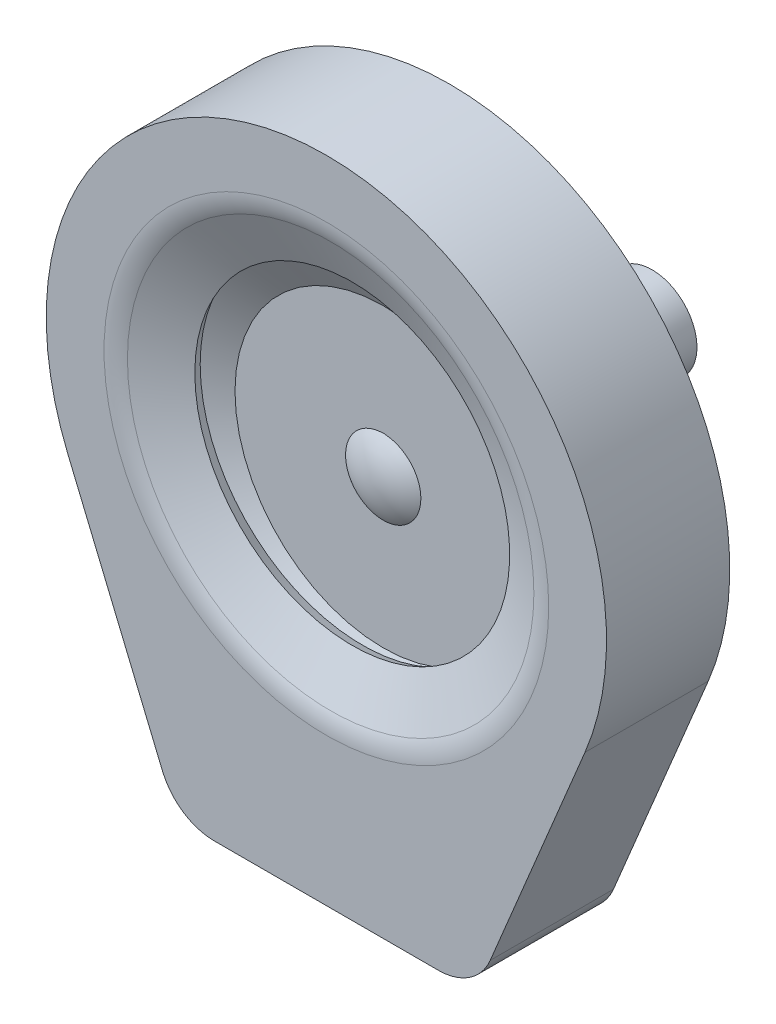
ISO-10303-21;
HEADER;
FILE_DESCRIPTION(('STEP AP214'),'2;1');
FILE_NAME('part.step','',(''),(''),'','','');
FILE_SCHEMA(('AUTOMOTIVE_DESIGN { 1 0 10303 214 1 1 1 1 }'));
ENDSEC;
DATA;
#1=APPLICATION_CONTEXT('core data for automotive mechanical design processes');
#2=APPLICATION_PROTOCOL_DEFINITION('international standard','automotive_design',2000,#1);
#3=PRODUCT_CONTEXT('',#1,'mechanical');
#4=PRODUCT('Part','Part','',(#3));
#5=PRODUCT_RELATED_PRODUCT_CATEGORY('part','',(#4));
#6=PRODUCT_DEFINITION_FORMATION('','',#4);
#7=PRODUCT_DEFINITION_CONTEXT('part definition',#1,'design');
#8=PRODUCT_DEFINITION('design','',#6,#7);
#9=PRODUCT_DEFINITION_SHAPE('','',#8);
#10=(LENGTH_UNIT() NAMED_UNIT(*) SI_UNIT(.MILLI.,.METRE.));
#11=(NAMED_UNIT(*) PLANE_ANGLE_UNIT() SI_UNIT($,.RADIAN.));
#12=(NAMED_UNIT(*) SI_UNIT($,.STERADIAN.) SOLID_ANGLE_UNIT());
#13=UNCERTAINTY_MEASURE_WITH_UNIT(LENGTH_MEASURE(1.E-05),#10,'distance_accuracy_value','');
#14=(GEOMETRIC_REPRESENTATION_CONTEXT(3) GLOBAL_UNCERTAINTY_ASSIGNED_CONTEXT((#13)) GLOBAL_UNIT_ASSIGNED_CONTEXT((#10,
#11,#12)) REPRESENTATION_CONTEXT('',''));
#15=CARTESIAN_POINT('',(0.,0.,0.));
#16=DIRECTION('',(0.,0.,1.));
#17=DIRECTION('',(1.,0.,0.));
#18=AXIS2_PLACEMENT_3D('',#15,#16,#17);
#19=CARTESIAN_POINT('',(0.,20.,2.14285714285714));
#20=DIRECTION('',(0.,0.,1.));
#21=DIRECTION('',(1.,0.,0.));
#22=AXIS2_PLACEMENT_3D('',#19,#20,#21);
#23=PLANE('',#22);
#24=CARTESIAN_POINT('',(0.,0.,2.14285714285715));
#25=DIRECTION('',(0.,0.,-1.));
#26=DIRECTION('',(-1.,0.,0.));
#27=AXIS2_PLACEMENT_3D('',#24,#25,#26);
#28=CIRCLE('',#27,20.);
#29=CARTESIAN_POINT('',(-20.,0.,2.14285714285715));
#30=VERTEX_POINT('',#29);
#31=EDGE_CURVE('E11',#30,#30,#28,.T.);
#32=ORIENTED_EDGE('',*,*,#31,.F.);
#33=EDGE_LOOP('',(#32));
#34=FACE_BOUND('',#33,.T.);
#35=ADVANCED_FACE('F41',(#34),#23,.T.);
#36=CARTESIAN_POINT('',(0.,0.,2.14285714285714));
#37=DIRECTION('',(0.,0.,-1.));
#38=DIRECTION('',(-1.,0.,0.));
#39=AXIS2_PLACEMENT_3D('',#36,#37,#38);
#40=CYLINDRICAL_SURFACE('',#39,20.);
#41=ORIENTED_EDGE('',*,*,#31,.T.);
#42=EDGE_LOOP('',(#41));
#43=FACE_BOUND('',#42,.T.);
#44=CARTESIAN_POINT('',(0.,0.,-3.85714285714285));
#45=DIRECTION('',(0.,0.,-1.));
#46=DIRECTION('',(-1.,0.,0.));
#47=AXIS2_PLACEMENT_3D('',#44,#45,#46);
#48=CIRCLE('',#47,20.);
#49=CARTESIAN_POINT('',(-20.,0.,-3.85714285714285));
#50=VERTEX_POINT('',#49);
#51=EDGE_CURVE('E47',#50,#50,#48,.T.);
#52=ORIENTED_EDGE('',*,*,#51,.F.);
#53=EDGE_LOOP('',(#52));
#54=FACE_BOUND('',#53,.T.);
#55=ADVANCED_FACE('F73',(#43,#54),#40,.T.);
#56=CARTESIAN_POINT('',(0.,4.,-3.85714285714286));
#57=DIRECTION('',(0.,0.,-1.));
#58=DIRECTION('',(-1.,0.,0.));
#59=AXIS2_PLACEMENT_3D('',#56,#57,#58);
#60=PLANE('',#59);
#61=ORIENTED_EDGE('',*,*,#51,.T.);
#62=EDGE_LOOP('',(#61));
#63=FACE_BOUND('',#62,.T.);
#64=CARTESIAN_POINT('',(0.,0.,-3.85714285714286));
#65=DIRECTION('',(0.,0.,-1.));
#66=DIRECTION('',(-1.,0.,0.));
#67=AXIS2_PLACEMENT_3D('',#64,#65,#66);
#68=CIRCLE('',#67,4.);
#69=CARTESIAN_POINT('',(-4.,0.,-3.85714285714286));
#70=VERTEX_POINT('',#69);
#71=EDGE_CURVE('E51',#70,#70,#68,.T.);
#72=ORIENTED_EDGE('',*,*,#71,.F.);
#73=EDGE_LOOP('',(#72));
#74=FACE_BOUND('',#73,.T.);
#75=ADVANCED_FACE('F65',(#63,#74),#60,.T.);
#76=CARTESIAN_POINT('',(0.,0.,2.14285714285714));
#77=DIRECTION('',(0.,0.,-1.));
#78=DIRECTION('',(-1.,0.,0.));
#79=AXIS2_PLACEMENT_3D('',#76,#77,#78);
#80=CYLINDRICAL_SURFACE('',#79,4.);
#81=ORIENTED_EDGE('',*,*,#71,.T.);
#82=EDGE_LOOP('',(#81));
#83=FACE_BOUND('',#82,.T.);
#84=CARTESIAN_POINT('',(0.,0.,-21.8571428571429));
#85=DIRECTION('',(0.,0.,-1.));
#86=DIRECTION('',(-1.,0.,0.));
#87=AXIS2_PLACEMENT_3D('',#84,#85,#86);
#88=CIRCLE('',#87,4.);
#89=CARTESIAN_POINT('',(-4.,0.,-21.8571428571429));
#90=VERTEX_POINT('',#89);
#91=EDGE_CURVE('E55',#90,#90,#88,.T.);
#92=ORIENTED_EDGE('',*,*,#91,.F.);
#93=EDGE_LOOP('',(#92));
#94=FACE_BOUND('',#93,.T.);
#95=ADVANCED_FACE('F63',(#83,#94),#80,.T.);
#96=CARTESIAN_POINT('',(0.,0.,-21.8571428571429));
#97=DIRECTION('',(0.,0.,-1.));
#98=DIRECTION('',(-1.,0.,0.));
#99=AXIS2_PLACEMENT_3D('',#96,#97,#98);
#100=PLANE('',#99);
#101=ORIENTED_EDGE('',*,*,#91,.T.);
#102=EDGE_LOOP('',(#101));
#103=FACE_BOUND('',#102,.T.);
#104=ADVANCED_FACE('F61',(#103),#100,.T.);
#105=CLOSED_SHELL('',(#35,#55,#75,#95,#104));
#106=MANIFOLD_SOLID_BREP('B2',#105);
#107=CARTESIAN_POINT('',(0.,18.,4.6673110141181));
#108=DIRECTION('',(0.,0.,-1.));
#109=DIRECTION('',(-1.,0.,0.));
#110=AXIS2_PLACEMENT_3D('',#107,#108,#109);
#111=PLANE('',#110);
#112=CARTESIAN_POINT('',(0.,0.,4.6673110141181));
#113=DIRECTION('',(0.,0.,-1.));
#114=DIRECTION('',(-1.,0.,0.));
#115=AXIS2_PLACEMENT_3D('',#112,#113,#114);
#116=CIRCLE('',#115,22.);
#117=CARTESIAN_POINT('',(-22.,0.,4.6673110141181));
#118=VERTEX_POINT('',#117);
#119=EDGE_CURVE('E40',#118,#118,#116,.T.);
#120=ORIENTED_EDGE('',*,*,#119,.T.);
#121=EDGE_LOOP('',(#120));
#122=FACE_BOUND('',#121,.T.);
#123=CARTESIAN_POINT('',(0.,0.,4.6673110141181));
#124=DIRECTION('',(0.,0.,-1.));
#125=DIRECTION('',(-1.,0.,0.));
#126=AXIS2_PLACEMENT_3D('',#123,#124,#125);
#127=CIRCLE('',#126,18.);
#128=CARTESIAN_POINT('',(18.,0.,4.6673110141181));
#129=VERTEX_POINT('',#128);
#130=EDGE_CURVE('E142',#129,#129,#127,.T.);
#131=ORIENTED_EDGE('',*,*,#130,.F.);
#132=EDGE_LOOP('',(#131));
#133=FACE_BOUND('',#132,.T.);
#134=ADVANCED_FACE('F120',(#122,#133),#111,.T.);
#135=CARTESIAN_POINT('',(0.,0.,-2.51611398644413));
#136=DIRECTION('',(0.,0.,-1.));
#137=DIRECTION('',(-1.,0.,0.));
#138=AXIS2_PLACEMENT_3D('',#135,#136,#137);
#139=CYLINDRICAL_SURFACE('',#138,22.);
#140=ORIENTED_EDGE('',*,*,#119,.F.);
#141=EDGE_LOOP('',(#140));
#142=FACE_BOUND('',#141,.T.);
#143=CARTESIAN_POINT('',(0.,0.,4.8673110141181));
#144=DIRECTION('',(0.,0.,-1.));
#145=DIRECTION('',(-1.,0.,0.));
#146=AXIS2_PLACEMENT_3D('',#143,#144,#145);
#147=CIRCLE('',#146,22.);
#148=CARTESIAN_POINT('',(-22.,0.,4.8673110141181));
#149=VERTEX_POINT('',#148);
#150=EDGE_CURVE('E126',#149,#149,#147,.T.);
#151=ORIENTED_EDGE('',*,*,#150,.T.);
#152=EDGE_LOOP('',(#151));
#153=FACE_BOUND('',#152,.T.);
#154=ADVANCED_FACE('F150',(#142,#153),#139,.T.);
#155=CARTESIAN_POINT('',(0.,18.,4.8673110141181));
#156=DIRECTION('',(0.,0.,-1.));
#157=DIRECTION('',(-1.,0.,0.));
#158=AXIS2_PLACEMENT_3D('',#155,#156,#157);
#159=PLANE('',#158);
#160=ORIENTED_EDGE('',*,*,#150,.F.);
#161=EDGE_LOOP('',(#160));
#162=FACE_BOUND('',#161,.T.);
#163=CARTESIAN_POINT('',(0.,0.,4.8673110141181));
#164=DIRECTION('',(0.,0.,-1.));
#165=DIRECTION('',(-1.,0.,0.));
#166=AXIS2_PLACEMENT_3D('',#163,#164,#165);
#167=CIRCLE('',#166,17.9464101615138);
#168=CARTESIAN_POINT('',(17.9464101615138,0.,4.8673110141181));
#169=VERTEX_POINT('',#168);
#170=EDGE_CURVE('E130',#169,#169,#167,.T.);
#171=ORIENTED_EDGE('',*,*,#170,.T.);
#172=EDGE_LOOP('',(#171));
#173=FACE_BOUND('',#172,.T.);
#174=ADVANCED_FACE('F154',(#162,#173),#159,.F.);
#175=CARTESIAN_POINT('',(0.,0.,-2.17552464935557));
#176=DIRECTION('',(0.,0.,1.));
#177=DIRECTION('',(1.,0.,0.));
#178=AXIS2_PLACEMENT_3D('',#175,#176,#177);
#179=CONICAL_SURFACE('',#178,5.74786096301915,1.0471975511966);
#180=CARTESIAN_POINT('',(0.,0.,-2.17552464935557));
#181=DIRECTION('',(0.,0.,-1.));
#182=DIRECTION('',(-1.,0.,0.));
#183=AXIS2_PLACEMENT_3D('',#180,#181,#182);
#184=CIRCLE('',#183,5.74786096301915);
#185=CARTESIAN_POINT('',(5.74786096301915,0.,-2.17552464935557));
#186=VERTEX_POINT('',#185);
#187=EDGE_CURVE('E134',#186,#186,#184,.T.);
#188=CARTESIAN_POINT('',(17.9464101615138,0.,4.8673110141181));
#189=CARTESIAN_POINT('',(17.8193419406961,0.,4.79394814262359));
#190=CARTESIAN_POINT('',(17.6922737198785,0.,4.72058527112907));
#191=CARTESIAN_POINT('',(17.4381372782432,0.,4.57385952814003));
#192=CARTESIAN_POINT('',(17.3110690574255,0.,4.50049665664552));
#193=CARTESIAN_POINT('',(17.0569326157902,0.,4.35377091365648));
#194=CARTESIAN_POINT('',(16.9298643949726,0.,4.28040804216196));
#195=CARTESIAN_POINT('',(16.6757279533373,0.,4.13368229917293));
#196=CARTESIAN_POINT('',(16.5486597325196,0.,4.06031942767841));
#197=CARTESIAN_POINT('',(16.2945232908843,0.,3.91359368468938));
#198=CARTESIAN_POINT('',(16.1674550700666,0.,3.84023081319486));
#199=CARTESIAN_POINT('',(15.9133186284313,0.,3.69350507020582));
#200=CARTESIAN_POINT('',(15.7862504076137,0.,3.62014219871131));
#201=CARTESIAN_POINT('',(15.5321139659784,0.,3.47341645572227));
#202=CARTESIAN_POINT('',(15.4050457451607,0.,3.40005358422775));
#203=CARTESIAN_POINT('',(15.1509093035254,0.,3.25332784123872));
#204=CARTESIAN_POINT('',(15.0238410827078,0.,3.1799649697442));
#205=CARTESIAN_POINT('',(14.7697046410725,0.,3.03323922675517));
#206=CARTESIAN_POINT('',(14.6426364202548,0.,2.95987635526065));
#207=CARTESIAN_POINT('',(14.3884999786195,0.,2.81315061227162));
#208=CARTESIAN_POINT('',(14.2614317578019,0.,2.7397877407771));
#209=CARTESIAN_POINT('',(14.0072953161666,0.,2.59306199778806));
#210=CARTESIAN_POINT('',(13.8802270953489,0.,2.51969912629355));
#211=CARTESIAN_POINT('',(13.6260906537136,0.,2.37297338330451));
#212=CARTESIAN_POINT('',(13.4990224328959,0.,2.29961051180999));
#213=CARTESIAN_POINT('',(13.2448859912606,0.,2.15288476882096));
#214=CARTESIAN_POINT('',(13.117817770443,0.,2.07952189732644));
#215=CARTESIAN_POINT('',(12.8636813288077,0.,1.93279615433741));
#216=CARTESIAN_POINT('',(12.73661310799,0.,1.85943328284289));
#217=CARTESIAN_POINT('',(12.4824766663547,0.,1.71270753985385));
#218=CARTESIAN_POINT('',(12.3554084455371,0.,1.63934466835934));
#219=CARTESIAN_POINT('',(12.1012720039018,0.,1.4926189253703));
#220=CARTESIAN_POINT('',(11.9742037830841,0.,1.41925605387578));
#221=CARTESIAN_POINT('',(11.7200673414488,0.,1.27253031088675));
#222=CARTESIAN_POINT('',(11.5929991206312,0.,1.19916743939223));
#223=CARTESIAN_POINT('',(11.3388626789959,0.,1.0524416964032));
#224=CARTESIAN_POINT('',(11.2117944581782,0.,0.97907882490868));
#225=CARTESIAN_POINT('',(10.9576580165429,0.,0.832353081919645));
#226=CARTESIAN_POINT('',(10.8305897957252,0.,0.758990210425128));
#227=CARTESIAN_POINT('',(10.5764533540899,0.,0.612264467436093));
#228=CARTESIAN_POINT('',(10.4493851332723,0.,0.538901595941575));
#229=CARTESIAN_POINT('',(10.195248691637,0.,0.39217585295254));
#230=CARTESIAN_POINT('',(10.0681804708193,0.,0.318812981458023));
#231=CARTESIAN_POINT('',(9.81404402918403,0.,0.172087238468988));
#232=CARTESIAN_POINT('',(9.68697580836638,0.,0.098724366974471));
#233=CARTESIAN_POINT('',(9.43283936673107,0.,-0.0480013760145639));
#234=CARTESIAN_POINT('',(9.30577114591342,0.,-0.121364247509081));
#235=CARTESIAN_POINT('',(9.05163470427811,0.,-0.268089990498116));
#236=CARTESIAN_POINT('',(8.92456648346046,0.,-0.341452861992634));
#237=CARTESIAN_POINT('',(8.67043004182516,0.,-0.488178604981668));
#238=CARTESIAN_POINT('',(8.5433618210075,0.,-0.561541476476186));
#239=CARTESIAN_POINT('',(8.2892253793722,0.,-0.708267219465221));
#240=CARTESIAN_POINT('',(8.16215715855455,0.,-0.781630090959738));
#241=CARTESIAN_POINT('',(7.90802071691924,0.,-0.928355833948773));
#242=CARTESIAN_POINT('',(7.78095249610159,0.,-1.00171870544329));
#243=CARTESIAN_POINT('',(7.52681605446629,0.,-1.14844444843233));
#244=CARTESIAN_POINT('',(7.39974783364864,0.,-1.22180731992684));
#245=CARTESIAN_POINT('',(7.14561139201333,0.,-1.36853306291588));
#246=CARTESIAN_POINT('',(7.01854317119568,0.,-1.44189593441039));
#247=CARTESIAN_POINT('',(6.76440672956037,0.,-1.58862167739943));
#248=CARTESIAN_POINT('',(6.63733850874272,0.,-1.66198454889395));
#249=CARTESIAN_POINT('',(6.38320206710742,0.,-1.80871029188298));
#250=CARTESIAN_POINT('',(6.25613384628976,0.,-1.8820731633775));
#251=CARTESIAN_POINT('',(6.00199740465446,0.,-2.02879890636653));
#252=CARTESIAN_POINT('',(5.87492918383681,0.,-2.10216177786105));
#253=CARTESIAN_POINT('',(5.74786096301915,0.,-2.17552464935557));
#254=B_SPLINE_CURVE_WITH_KNOTS('',3,(#188,#189,#190,#191,#192,#193,#194,#195,#196,#197,#198,
#199,#200,#201,#202,#203,#204,#205,#206,#207,#208,#209,#210,#211,#212,#213,#214,#215,#216,#217,
#218,#219,#220,#221,#222,#223,#224,#225,#226,#227,#228,#229,#230,#231,#232,#233,#234,#235,#236,
#237,#238,#239,#240,#241,#242,#243,#244,#245,#246,#247,#248,#249,#250,#251,#252,#253),
.UNSPECIFIED.,.F.,.F.,(4,2,2,2,2,2,2,2,2,2,2,2,2,2,2,2,2,2,2,2,2,2,2,2,2,2,2,2,2,2,2,2,4),(0.,
0.440177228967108,0.88035445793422,1.32053168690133,1.76070891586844,2.20088614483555,
2.64106337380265,3.08124060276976,3.52141783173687,3.96159506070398,4.40177228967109,
4.8419495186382,5.2821267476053,5.72230397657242,6.16248120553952,6.60265843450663,
7.04283566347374,7.48301289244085,7.92319012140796,8.36336735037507,8.80354457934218,
9.24372180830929,9.6838990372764,10.1240762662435,10.5642534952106,11.0044307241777,
11.4446079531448,11.8847851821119,12.324962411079,12.7651396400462,13.2053168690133,
13.6454940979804,14.0856713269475),.UNSPECIFIED.);
#255=EDGE_CURVE('BSEAM159',#169,#186,#254,.T.);
#256=ORIENTED_EDGE('',*,*,#170,.F.);
#257=ORIENTED_EDGE('',*,*,#187,.T.);
#258=ORIENTED_EDGE('',*,*,#255,.T.);
#259=ORIENTED_EDGE('',*,*,#255,.F.);
#260=EDGE_LOOP('',(#256,#258,#257,#259));
#261=FACE_BOUND('',#260,.T.);
#262=ADVANCED_FACE('F159',(#261),#179,.F.);
#263=CARTESIAN_POINT('',(0.,0.,-2.51611398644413));
#264=DIRECTION('',(0.,0.,-1.));
#265=DIRECTION('',(0.,1.,0.));
#266=AXIS2_PLACEMENT_3D('',#263,#264,#265);
#267=SPHERICAL_SURFACE('',#266,5.75794292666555);
#268=ORIENTED_EDGE('',*,*,#187,.F.);
#269=EDGE_LOOP('',(#268));
#270=FACE_BOUND('',#269,.T.);
#271=ADVANCED_FACE('F165',(#270),#267,.T.);
#272=CARTESIAN_POINT('',(0.,0.,-2.51611398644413));
#273=DIRECTION('',(0.,0.,-1.));
#274=DIRECTION('',(0.,1.,0.));
#275=AXIS2_PLACEMENT_3D('',#272,#273,#274);
#276=SPHERICAL_SURFACE('',#275,5.55794292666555);
#277=CARTESIAN_POINT('',(0.,0.,-2.51611398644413));
#278=DIRECTION('',(0.,0.,-1.));
#279=DIRECTION('',(-1.,0.,0.));
#280=AXIS2_PLACEMENT_3D('',#277,#278,#279);
#281=CIRCLE('',#280,5.55794292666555);
#282=CARTESIAN_POINT('',(5.55794292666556,0.,-2.51611398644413));
#283=VERTEX_POINT('',#282);
#284=EDGE_CURVE('E139',#283,#283,#281,.T.);
#285=ORIENTED_EDGE('',*,*,#284,.T.);
#286=EDGE_LOOP('',(#285));
#287=FACE_BOUND('',#286,.T.);
#288=ADVANCED_FACE('F169',(#287),#276,.F.);
#289=CARTESIAN_POINT('',(0.,0.,-2.51611398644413));
#290=DIRECTION('',(0.,0.,1.));
#291=DIRECTION('',(1.,0.,0.));
#292=AXIS2_PLACEMENT_3D('',#289,#290,#291);
#293=CONICAL_SURFACE('',#292,5.55794292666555,1.0471975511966);
#294=CARTESIAN_POINT('',(18.,0.,4.6673110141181));
#295=CARTESIAN_POINT('',(17.8703952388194,0.,4.59248367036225));
#296=CARTESIAN_POINT('',(17.7407904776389,0.,4.51765632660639));
#297=CARTESIAN_POINT('',(17.4815809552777,0.,4.36800163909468));
#298=CARTESIAN_POINT('',(17.3519761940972,0.,4.29317429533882));
#299=CARTESIAN_POINT('',(17.092766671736,0.,4.14351960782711));
#300=CARTESIAN_POINT('',(16.9631619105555,0.,4.06869226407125));
#301=CARTESIAN_POINT('',(16.7039523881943,0.,3.91903757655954));
#302=CARTESIAN_POINT('',(16.5743476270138,0.,3.84421023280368));
#303=CARTESIAN_POINT('',(16.3151381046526,0.,3.69455554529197));
#304=CARTESIAN_POINT('',(16.1855333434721,0.,3.61972820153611));
#305=CARTESIAN_POINT('',(15.9263238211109,0.,3.4700735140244));
#306=CARTESIAN_POINT('',(15.7967190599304,0.,3.39524617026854));
#307=CARTESIAN_POINT('',(15.5375095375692,0.,3.24559148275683));
#308=CARTESIAN_POINT('',(15.4079047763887,0.,3.17076413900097));
#309=CARTESIAN_POINT('',(15.1486952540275,0.,3.02110945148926));
#310=CARTESIAN_POINT('',(15.019090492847,0.,2.9462821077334));
#311=CARTESIAN_POINT('',(14.7598809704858,0.,2.79662742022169));
#312=CARTESIAN_POINT('',(14.6302762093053,0.,2.72180007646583));
#313=CARTESIAN_POINT('',(14.3710666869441,0.,2.57214538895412));
#314=CARTESIAN_POINT('',(14.2414619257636,0.,2.49731804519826));
#315=CARTESIAN_POINT('',(13.9822524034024,0.,2.34766335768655));
#316=CARTESIAN_POINT('',(13.8526476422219,0.,2.27283601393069));
#317=CARTESIAN_POINT('',(13.5934381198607,0.,2.12318132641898));
#318=CARTESIAN_POINT('',(13.4638333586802,0.,2.04835398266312));
#319=CARTESIAN_POINT('',(13.204623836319,0.,1.89869929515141));
#320=CARTESIAN_POINT('',(13.0750190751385,0.,1.82387195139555));
#321=CARTESIAN_POINT('',(12.8158095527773,0.,1.67421726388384));
#322=CARTESIAN_POINT('',(12.6862047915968,0.,1.59938992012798));
#323=CARTESIAN_POINT('',(12.4269952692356,0.,1.44973523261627));
#324=CARTESIAN_POINT('',(12.2973905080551,0.,1.37490788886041));
#325=CARTESIAN_POINT('',(12.0381809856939,0.,1.2252532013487));
#326=CARTESIAN_POINT('',(11.9085762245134,0.,1.15042585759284));
#327=CARTESIAN_POINT('',(11.6493667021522,0.,1.00077117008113));
#328=CARTESIAN_POINT('',(11.5197619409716,0.,0.925943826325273));
#329=CARTESIAN_POINT('',(11.2605524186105,0.,0.77628913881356));
#330=CARTESIAN_POINT('',(11.1309476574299,0.,0.701461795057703));
#331=CARTESIAN_POINT('',(10.8717381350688,0.,0.55180710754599));
#332=CARTESIAN_POINT('',(10.7421333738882,0.,0.476979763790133));
#333=CARTESIAN_POINT('',(10.4829238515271,0.,0.32732507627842));
#334=CARTESIAN_POINT('',(10.3533190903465,0.,0.252497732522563));
#335=CARTESIAN_POINT('',(10.0941095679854,0.,0.10284304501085));
#336=CARTESIAN_POINT('',(9.96450480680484,0.,0.0280157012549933));
#337=CARTESIAN_POINT('',(9.70529528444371,0.,-0.12163898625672));
#338=CARTESIAN_POINT('',(9.57569052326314,0.,-0.196466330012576));
#339=CARTESIAN_POINT('',(9.31648100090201,0.,-0.34612101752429));
#340=CARTESIAN_POINT('',(9.18687623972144,0.,-0.420948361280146));
#341=CARTESIAN_POINT('',(8.9276667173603,0.,-0.57060304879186));
#342=CARTESIAN_POINT('',(8.79806195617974,0.,-0.645430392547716));
#343=CARTESIAN_POINT('',(8.5388524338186,0.,-0.795085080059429));
#344=CARTESIAN_POINT('',(8.40924767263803,0.,-0.869912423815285));
#345=CARTESIAN_POINT('',(8.1500381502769,0.,-1.019567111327));
#346=CARTESIAN_POINT('',(8.02043338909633,0.,-1.09439445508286));
#347=CARTESIAN_POINT('',(7.7612238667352,0.,-1.24404914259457));
#348=CARTESIAN_POINT('',(7.63161910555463,0.,-1.31887648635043));
#349=CARTESIAN_POINT('',(7.3724095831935,0.,-1.46853117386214));
#350=CARTESIAN_POINT('',(7.24280482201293,0.,-1.543358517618));
#351=CARTESIAN_POINT('',(6.9835952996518,0.,-1.69301320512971));
#352=CARTESIAN_POINT('',(6.85399053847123,0.,-1.76784054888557));
#353=CARTESIAN_POINT('',(6.59478101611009,0.,-1.91749523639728));
#354=CARTESIAN_POINT('',(6.46517625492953,0.,-1.99232258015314));
#355=CARTESIAN_POINT('',(6.20596673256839,0.,-2.14197726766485));
#356=CARTESIAN_POINT('',(6.07636197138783,0.,-2.2168046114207));
#357=CARTESIAN_POINT('',(5.81715244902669,0.,-2.36645929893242));
#358=CARTESIAN_POINT('',(5.68754768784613,0.,-2.44128664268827));
#359=CARTESIAN_POINT('',(5.55794292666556,0.,-2.51611398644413));
#360=B_SPLINE_CURVE_WITH_KNOTS('',3,(#294,#295,#296,#297,#298,#299,#300,#301,#302,#303,#304,
#305,#306,#307,#308,#309,#310,#311,#312,#313,#314,#315,#316,#317,#318,#319,#320,#321,#322,#323,
#324,#325,#326,#327,#328,#329,#330,#331,#332,#333,#334,#335,#336,#337,#338,#339,#340,#341,#342,
#343,#344,#345,#346,#347,#348,#349,#350,#351,#352,#353,#354,#355,#356,#357,#358,#359),
.UNSPECIFIED.,.F.,.F.,(4,2,2,2,2,2,2,2,2,2,2,2,2,2,2,2,2,2,2,2,2,2,2,2,2,2,2,2,2,2,2,2,4),(0.,
0.448964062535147,0.897928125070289,1.34689218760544,1.79585625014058,2.24482031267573,
2.69378437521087,3.14274843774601,3.59171250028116,4.0406765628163,4.48964062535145,
4.93860468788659,5.38756875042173,5.83653281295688,6.28549687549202,6.73446093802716,
7.18342500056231,7.63238906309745,8.0813531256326,8.53031718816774,8.97928125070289,
9.42824531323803,9.87720937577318,10.3261734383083,10.7751375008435,11.2241015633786,
11.6730656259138,12.1220296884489,12.570993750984,13.0199578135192,13.4689218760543,
13.9178859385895,14.3668500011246),.UNSPECIFIED.);
#361=EDGE_CURVE('BSEAM146',#129,#283,#360,.T.);
#362=ORIENTED_EDGE('',*,*,#130,.T.);
#363=ORIENTED_EDGE('',*,*,#284,.F.);
#364=ORIENTED_EDGE('',*,*,#361,.T.);
#365=ORIENTED_EDGE('',*,*,#361,.F.);
#366=EDGE_LOOP('',(#362,#364,#363,#365));
#367=FACE_BOUND('',#366,.T.);
#368=ADVANCED_FACE('F146',(#367),#293,.T.);
#369=CLOSED_SHELL('',(#134,#154,#174,#262,#271,#288,#368));
#370=MANIFOLD_SOLID_BREP('B6',#369);
#371=CARTESIAN_POINT('',(0.,2.38841835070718,-3.78590922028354));
#372=DIRECTION('',(0.,0.,1.));
#373=DIRECTION('',(1.,0.,0.));
#374=AXIS2_PLACEMENT_3D('',#371,#372,#373);
#375=PLANE('',#374);
#376=CARTESIAN_POINT('',(0.,2.38841835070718,-3.78590922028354));
#377=DIRECTION('',(0.,0.,1.));
#378=DIRECTION('',(1.,0.,0.));
#379=AXIS2_PLACEMENT_3D('',#376,#377,#378);
#380=CIRCLE('',#379,25.);
#381=CARTESIAN_POINT('',(23.0784258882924,-7.22335872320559,-3.78590922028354));
#382=VERTEX_POINT('',#381);
#383=CARTESIAN_POINT('',(-23.0784258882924,-7.22335872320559,-3.78590922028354));
#384=VERTEX_POINT('',#383);
#385=EDGE_CURVE('E319',#382,#384,#380,.T.);
#386=ORIENTED_EDGE('',*,*,#385,.F.);
#387=DIRECTION('',(0.384471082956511,0.923137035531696,0.));
#388=VECTOR('',#387,1.);
#389=CARTESIAN_POINT('',(14.6194108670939,-27.5339370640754,-3.78590922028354));
#390=LINE('',#389,#388);
#391=CARTESIAN_POINT('',(14.6194108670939,-27.5339370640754,-3.78590922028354));
#392=VERTEX_POINT('',#391);
#393=EDGE_CURVE('E243',#392,#382,#390,.T.);
#394=ORIENTED_EDGE('',*,*,#393,.F.);
#395=CARTESIAN_POINT('',(10.0037256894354,-25.6115816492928,-3.78590922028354));
#396=DIRECTION('',(0.,0.,1.));
#397=DIRECTION('',(1.,0.,0.));
#398=AXIS2_PLACEMENT_3D('',#395,#396,#397);
#399=CIRCLE('',#398,5.);
#400=CARTESIAN_POINT('',(10.0037256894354,-30.6115816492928,-3.78590922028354));
#401=VERTEX_POINT('',#400);
#402=EDGE_CURVE('E404',#401,#392,#399,.T.);
#403=ORIENTED_EDGE('',*,*,#402,.F.);
#404=DIRECTION('',(1.,0.,0.));
#405=VECTOR('',#404,1.);
#406=CARTESIAN_POINT('',(-10.0037256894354,-30.6115816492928,-3.78590922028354));
#407=LINE('',#406,#405);
#408=CARTESIAN_POINT('',(-10.0037256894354,-30.6115816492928,-3.78590922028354));
#409=VERTEX_POINT('',#408);
#410=EDGE_CURVE('E402',#409,#401,#407,.T.);
#411=ORIENTED_EDGE('',*,*,#410,.F.);
#412=CARTESIAN_POINT('',(-10.0037256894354,-25.6115816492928,-3.78590922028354));
#413=DIRECTION('',(0.,0.,1.));
#414=DIRECTION('',(1.,0.,0.));
#415=AXIS2_PLACEMENT_3D('',#412,#413,#414);
#416=CIRCLE('',#415,5.);
#417=CARTESIAN_POINT('',(-14.6194108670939,-27.5339370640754,-3.78590922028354));
#418=VERTEX_POINT('',#417);
#419=EDGE_CURVE('E400',#418,#409,#416,.T.);
#420=ORIENTED_EDGE('',*,*,#419,.F.);
#421=DIRECTION('',(0.384471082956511,-0.923137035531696,0.));
#422=VECTOR('',#421,1.);
#423=CARTESIAN_POINT('',(-14.6194108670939,-27.5339370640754,-3.78590922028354));
#424=LINE('',#423,#422);
#425=EDGE_CURVE('E398',#384,#418,#424,.T.);
#426=ORIENTED_EDGE('',*,*,#425,.F.);
#427=EDGE_LOOP('',(#386,#394,#403,#411,#420,#426));
#428=FACE_BOUND('',#427,.T.);
#429=CARTESIAN_POINT('',(0.,2.38841835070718,-3.78590922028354));
#430=DIRECTION('',(0.,0.,1.));
#431=DIRECTION('',(1.,0.,0.));
#432=AXIS2_PLACEMENT_3D('',#429,#430,#431);
#433=CIRCLE('',#432,24.);
#434=CARTESIAN_POINT('',(22.1552888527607,-6.83888764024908,-3.78590922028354));
#435=VERTEX_POINT('',#434);
#436=CARTESIAN_POINT('',(-22.1552888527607,-6.83888764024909,-3.78590922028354));
#437=VERTEX_POINT('',#436);
#438=EDGE_CURVE('E235',#435,#437,#433,.T.);
#439=ORIENTED_EDGE('',*,*,#438,.T.);
#440=DIRECTION('',(0.384471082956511,-0.923137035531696,0.));
#441=VECTOR('',#440,1.);
#442=CARTESIAN_POINT('',(-13.6962738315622,-27.1494659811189,-3.78590922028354));
#443=LINE('',#442,#441);
#444=CARTESIAN_POINT('',(-13.6962738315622,-27.1494659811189,-3.78590922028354));
#445=VERTEX_POINT('',#444);
#446=EDGE_CURVE('E372',#437,#445,#443,.T.);
#447=ORIENTED_EDGE('',*,*,#446,.T.);
#448=CARTESIAN_POINT('',(-10.0037256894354,-25.6115816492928,-3.78590922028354));
#449=DIRECTION('',(0.,0.,1.));
#450=DIRECTION('',(1.,0.,0.));
#451=AXIS2_PLACEMENT_3D('',#448,#449,#450);
#452=CIRCLE('',#451,4.);
#453=CARTESIAN_POINT('',(-10.0037256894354,-29.6115816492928,-3.78590922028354));
#454=VERTEX_POINT('',#453);
#455=EDGE_CURVE('E375',#445,#454,#452,.T.);
#456=ORIENTED_EDGE('',*,*,#455,.T.);
#457=DIRECTION('',(1.,0.,0.));
#458=VECTOR('',#457,1.);
#459=CARTESIAN_POINT('',(-10.0037256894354,-29.6115816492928,-3.78590922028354));
#460=LINE('',#459,#458);
#461=CARTESIAN_POINT('',(10.0037256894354,-29.6115816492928,-3.78590922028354));
#462=VERTEX_POINT('',#461);
#463=EDGE_CURVE('E378',#454,#462,#460,.T.);
#464=ORIENTED_EDGE('',*,*,#463,.T.);
#465=CARTESIAN_POINT('',(10.0037256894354,-25.6115816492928,-3.78590922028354));
#466=DIRECTION('',(0.,0.,1.));
#467=DIRECTION('',(1.,0.,0.));
#468=AXIS2_PLACEMENT_3D('',#465,#466,#467);
#469=CIRCLE('',#468,4.);
#470=CARTESIAN_POINT('',(13.6962738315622,-27.1494659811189,-3.78590922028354));
#471=VERTEX_POINT('',#470);
#472=EDGE_CURVE('E381',#462,#471,#469,.T.);
#473=ORIENTED_EDGE('',*,*,#472,.T.);
#474=DIRECTION('',(0.384471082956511,0.923137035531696,0.));
#475=VECTOR('',#474,1.);
#476=CARTESIAN_POINT('',(13.6962738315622,-27.1494659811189,-3.78590922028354));
#477=LINE('',#476,#475);
#478=EDGE_CURVE('E355',#471,#435,#477,.T.);
#479=ORIENTED_EDGE('',*,*,#478,.T.);
#480=EDGE_LOOP('',(#439,#447,#456,#464,#473,#479));
#481=FACE_BOUND('',#480,.T.);
#482=ADVANCED_FACE('F220',(#428,#481),#375,.F.);
#483=CARTESIAN_POINT('',(0.,2.38841835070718,6.21409077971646));
#484=DIRECTION('',(0.,0.,-1.));
#485=DIRECTION('',(-1.,0.,0.));
#486=AXIS2_PLACEMENT_3D('',#483,#484,#485);
#487=CYLINDRICAL_SURFACE('',#486,25.);
#488=ORIENTED_EDGE('',*,*,#385,.T.);
#489=DIRECTION('',(0.,0.,-1.));
#490=VECTOR('',#489,1.);
#491=CARTESIAN_POINT('',(-23.0784258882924,-7.22335872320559,6.21409077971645));
#492=LINE('',#491,#490);
#493=CARTESIAN_POINT('',(-23.0784258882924,-7.2233587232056,7.21409077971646));
#494=VERTEX_POINT('',#493);
#495=EDGE_CURVE('E313',#494,#384,#492,.T.);
#496=ORIENTED_EDGE('',*,*,#495,.F.);
#497=CARTESIAN_POINT('',(0.,2.38841835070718,7.21409077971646));
#498=DIRECTION('',(0.,0.,1.));
#499=DIRECTION('',(1.,0.,0.));
#500=AXIS2_PLACEMENT_3D('',#497,#498,#499);
#501=CIRCLE('',#500,25.);
#502=CARTESIAN_POINT('',(23.0784258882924,-7.22335872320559,7.21409077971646));
#503=VERTEX_POINT('',#502);
#504=EDGE_CURVE('E317',#503,#494,#501,.T.);
#505=ORIENTED_EDGE('',*,*,#504,.F.);
#506=DIRECTION('',(0.,0.,-1.));
#507=VECTOR('',#506,1.);
#508=CARTESIAN_POINT('',(23.0784258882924,-7.22335872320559,6.21409077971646));
#509=LINE('',#508,#507);
#510=EDGE_CURVE('E407',#503,#382,#509,.T.);
#511=ORIENTED_EDGE('',*,*,#510,.T.);
#512=EDGE_LOOP('',(#488,#496,#505,#511));
#513=FACE_BOUND('',#512,.T.);
#514=ADVANCED_FACE('F315',(#513),#487,.T.);
#515=CARTESIAN_POINT('',(-14.6194108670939,-27.5339370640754,6.21409077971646));
#516=DIRECTION('',(0.923137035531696,0.384471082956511,0.));
#517=DIRECTION('',(-0.384471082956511,0.923137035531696,0.));
#518=AXIS2_PLACEMENT_3D('',#515,#516,#517);
#519=PLANE('',#518);
#520=ORIENTED_EDGE('',*,*,#425,.T.);
#521=DIRECTION('',(0.,0.,-1.));
#522=VECTOR('',#521,1.);
#523=CARTESIAN_POINT('',(-14.6194108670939,-27.5339370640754,6.21409077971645));
#524=LINE('',#523,#522);
#525=CARTESIAN_POINT('',(-14.6194108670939,-27.5339370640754,7.21409077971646));
#526=VERTEX_POINT('',#525);
#527=EDGE_CURVE('E321',#526,#418,#524,.T.);
#528=ORIENTED_EDGE('',*,*,#527,.F.);
#529=DIRECTION('',(0.384471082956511,-0.923137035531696,0.));
#530=VECTOR('',#529,1.);
#531=CARTESIAN_POINT('',(-23.0784258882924,-7.2233587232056,7.21409077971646));
#532=LINE('',#531,#530);
#533=EDGE_CURVE('E324',#494,#526,#532,.T.);
#534=ORIENTED_EDGE('',*,*,#533,.F.);
#535=ORIENTED_EDGE('',*,*,#495,.T.);
#536=EDGE_LOOP('',(#520,#528,#534,#535));
#537=FACE_BOUND('',#536,.T.);
#538=ADVANCED_FACE('F325',(#537),#519,.F.);
#539=CARTESIAN_POINT('',(-10.0037256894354,-25.6115816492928,6.21409077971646));
#540=DIRECTION('',(0.,0.,-1.));
#541=DIRECTION('',(-1.,0.,0.));
#542=AXIS2_PLACEMENT_3D('',#539,#540,#541);
#543=CYLINDRICAL_SURFACE('',#542,5.);
#544=ORIENTED_EDGE('',*,*,#419,.T.);
#545=DIRECTION('',(0.,0.,-1.));
#546=VECTOR('',#545,1.);
#547=CARTESIAN_POINT('',(-10.0037256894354,-30.6115816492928,6.21409077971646));
#548=LINE('',#547,#546);
#549=CARTESIAN_POINT('',(-10.0037256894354,-30.6115816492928,7.21409077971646));
#550=VERTEX_POINT('',#549);
#551=EDGE_CURVE('E414',#550,#409,#548,.T.);
#552=ORIENTED_EDGE('',*,*,#551,.F.);
#553=CARTESIAN_POINT('',(-10.0037256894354,-25.6115816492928,7.21409077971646));
#554=DIRECTION('',(0.,0.,1.));
#555=DIRECTION('',(1.,0.,0.));
#556=AXIS2_PLACEMENT_3D('',#553,#554,#555);
#557=CIRCLE('',#556,5.);
#558=EDGE_CURVE('E330',#526,#550,#557,.T.);
#559=ORIENTED_EDGE('',*,*,#558,.F.);
#560=ORIENTED_EDGE('',*,*,#527,.T.);
#561=EDGE_LOOP('',(#544,#552,#559,#560));
#562=FACE_BOUND('',#561,.T.);
#563=ADVANCED_FACE('F452',(#562),#543,.T.);
#564=CARTESIAN_POINT('',(-10.0037256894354,-30.6115816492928,6.21409077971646));
#565=DIRECTION('',(0.,1.,0.));
#566=DIRECTION('',(0.,0.,1.));
#567=AXIS2_PLACEMENT_3D('',#564,#565,#566);
#568=PLANE('',#567);
#569=ORIENTED_EDGE('',*,*,#410,.T.);
#570=DIRECTION('',(0.,0.,-1.));
#571=VECTOR('',#570,1.);
#572=CARTESIAN_POINT('',(10.0037256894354,-30.6115816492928,6.21409077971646));
#573=LINE('',#572,#571);
#574=CARTESIAN_POINT('',(10.0037256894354,-30.6115816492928,7.21409077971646));
#575=VERTEX_POINT('',#574);
#576=EDGE_CURVE('E411',#575,#401,#573,.T.);
#577=ORIENTED_EDGE('',*,*,#576,.F.);
#578=DIRECTION('',(1.,0.,0.));
#579=VECTOR('',#578,1.);
#580=CARTESIAN_POINT('',(-10.0037256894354,-30.6115816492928,7.21409077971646));
#581=LINE('',#580,#579);
#582=EDGE_CURVE('E345',#550,#575,#581,.T.);
#583=ORIENTED_EDGE('',*,*,#582,.F.);
#584=ORIENTED_EDGE('',*,*,#551,.T.);
#585=EDGE_LOOP('',(#569,#577,#583,#584));
#586=FACE_BOUND('',#585,.T.);
#587=ADVANCED_FACE('F448',(#586),#568,.F.);
#588=CARTESIAN_POINT('',(10.0037256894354,-25.6115816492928,6.21409077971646));
#589=DIRECTION('',(0.,0.,-1.));
#590=DIRECTION('',(-1.,0.,0.));
#591=AXIS2_PLACEMENT_3D('',#588,#589,#590);
#592=CYLINDRICAL_SURFACE('',#591,5.);
#593=ORIENTED_EDGE('',*,*,#402,.T.);
#594=DIRECTION('',(0.,0.,-1.));
#595=VECTOR('',#594,1.);
#596=CARTESIAN_POINT('',(14.6194108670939,-27.5339370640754,6.21409077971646));
#597=LINE('',#596,#595);
#598=CARTESIAN_POINT('',(14.6194108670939,-27.5339370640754,7.21409077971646));
#599=VERTEX_POINT('',#598);
#600=EDGE_CURVE('E409',#599,#392,#597,.T.);
#601=ORIENTED_EDGE('',*,*,#600,.F.);
#602=CARTESIAN_POINT('',(10.0037256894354,-25.6115816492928,7.21409077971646));
#603=DIRECTION('',(0.,0.,1.));
#604=DIRECTION('',(1.,0.,0.));
#605=AXIS2_PLACEMENT_3D('',#602,#603,#604);
#606=CIRCLE('',#605,5.);
#607=EDGE_CURVE('E348',#575,#599,#606,.T.);
#608=ORIENTED_EDGE('',*,*,#607,.F.);
#609=ORIENTED_EDGE('',*,*,#576,.T.);
#610=EDGE_LOOP('',(#593,#601,#608,#609));
#611=FACE_BOUND('',#610,.T.);
#612=ADVANCED_FACE('F445',(#611),#592,.T.);
#613=CARTESIAN_POINT('',(14.6194108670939,-27.5339370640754,6.21409077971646));
#614=DIRECTION('',(-0.923137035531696,0.384471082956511,0.));
#615=DIRECTION('',(-0.384471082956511,-0.923137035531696,0.));
#616=AXIS2_PLACEMENT_3D('',#613,#614,#615);
#617=PLANE('',#616);
#618=ORIENTED_EDGE('',*,*,#393,.T.);
#619=ORIENTED_EDGE('',*,*,#510,.F.);
#620=DIRECTION('',(0.384471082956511,0.923137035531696,0.));
#621=VECTOR('',#620,1.);
#622=CARTESIAN_POINT('',(14.6194108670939,-27.5339370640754,7.21409077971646));
#623=LINE('',#622,#621);
#624=EDGE_CURVE('E336',#599,#503,#623,.T.);
#625=ORIENTED_EDGE('',*,*,#624,.F.);
#626=ORIENTED_EDGE('',*,*,#600,.T.);
#627=EDGE_LOOP('',(#618,#619,#625,#626));
#628=FACE_BOUND('',#627,.T.);
#629=ADVANCED_FACE('F442',(#628),#617,.F.);
#630=CARTESIAN_POINT('',(0.,2.38841835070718,6.21409077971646));
#631=DIRECTION('',(0.,0.,-1.));
#632=DIRECTION('',(-1.,0.,0.));
#633=AXIS2_PLACEMENT_3D('',#630,#631,#632);
#634=CYLINDRICAL_SURFACE('',#633,24.);
#635=ORIENTED_EDGE('',*,*,#438,.F.);
#636=DIRECTION('',(0.,0.,-1.));
#637=VECTOR('',#636,1.);
#638=CARTESIAN_POINT('',(22.1552888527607,-6.83888764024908,6.21409077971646));
#639=LINE('',#638,#637);
#640=CARTESIAN_POINT('',(22.1552888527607,-6.83888764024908,6.21409077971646));
#641=VERTEX_POINT('',#640);
#642=EDGE_CURVE('E370',#641,#435,#639,.T.);
#643=ORIENTED_EDGE('',*,*,#642,.F.);
#644=CARTESIAN_POINT('',(0.,2.38841835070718,6.21409077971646));
#645=DIRECTION('',(0.,0.,1.));
#646=DIRECTION('',(1.,0.,0.));
#647=AXIS2_PLACEMENT_3D('',#644,#645,#646);
#648=CIRCLE('',#647,24.);
#649=CARTESIAN_POINT('',(-22.1552888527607,-6.83888764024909,6.21409077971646));
#650=VERTEX_POINT('',#649);
#651=EDGE_CURVE('E351',#641,#650,#648,.T.);
#652=ORIENTED_EDGE('',*,*,#651,.T.);
#653=DIRECTION('',(0.,0.,-1.));
#654=VECTOR('',#653,1.);
#655=CARTESIAN_POINT('',(-22.1552888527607,-6.83888764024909,6.21409077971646));
#656=LINE('',#655,#654);
#657=EDGE_CURVE('E395',#650,#437,#656,.T.);
#658=ORIENTED_EDGE('',*,*,#657,.T.);
#659=EDGE_LOOP('',(#635,#643,#652,#658));
#660=FACE_BOUND('',#659,.T.);
#661=ADVANCED_FACE('F440',(#660),#634,.F.);
#662=CARTESIAN_POINT('',(-13.6962738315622,-27.1494659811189,6.21409077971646));
#663=DIRECTION('',(0.923137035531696,0.384471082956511,0.));
#664=DIRECTION('',(-0.384471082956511,0.923137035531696,0.));
#665=AXIS2_PLACEMENT_3D('',#662,#663,#664);
#666=PLANE('',#665);
#667=ORIENTED_EDGE('',*,*,#446,.F.);
#668=ORIENTED_EDGE('',*,*,#657,.F.);
#669=DIRECTION('',(0.384471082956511,-0.923137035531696,0.));
#670=VECTOR('',#669,1.);
#671=CARTESIAN_POINT('',(-13.6962738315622,-27.1494659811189,6.21409077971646));
#672=LINE('',#671,#670);
#673=CARTESIAN_POINT('',(-13.6962738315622,-27.1494659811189,6.21409077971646));
#674=VERTEX_POINT('',#673);
#675=EDGE_CURVE('E354',#650,#674,#672,.T.);
#676=ORIENTED_EDGE('',*,*,#675,.T.);
#677=DIRECTION('',(0.,0.,-1.));
#678=VECTOR('',#677,1.);
#679=CARTESIAN_POINT('',(-13.6962738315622,-27.1494659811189,6.21409077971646));
#680=LINE('',#679,#678);
#681=EDGE_CURVE('E393',#674,#445,#680,.T.);
#682=ORIENTED_EDGE('',*,*,#681,.T.);
#683=EDGE_LOOP('',(#667,#668,#676,#682));
#684=FACE_BOUND('',#683,.T.);
#685=ADVANCED_FACE('F484',(#684),#666,.T.);
#686=CARTESIAN_POINT('',(-10.0037256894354,-25.6115816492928,6.21409077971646));
#687=DIRECTION('',(0.,0.,-1.));
#688=DIRECTION('',(-1.,0.,0.));
#689=AXIS2_PLACEMENT_3D('',#686,#687,#688);
#690=CYLINDRICAL_SURFACE('',#689,4.);
#691=ORIENTED_EDGE('',*,*,#455,.F.);
#692=ORIENTED_EDGE('',*,*,#681,.F.);
#693=CARTESIAN_POINT('',(-10.0037256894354,-25.6115816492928,6.21409077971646));
#694=DIRECTION('',(0.,0.,1.));
#695=DIRECTION('',(1.,0.,0.));
#696=AXIS2_PLACEMENT_3D('',#693,#694,#695);
#697=CIRCLE('',#696,4.);
#698=CARTESIAN_POINT('',(-10.0037256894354,-29.6115816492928,6.21409077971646));
#699=VERTEX_POINT('',#698);
#700=EDGE_CURVE('E358',#674,#699,#697,.T.);
#701=ORIENTED_EDGE('',*,*,#700,.T.);
#702=DIRECTION('',(0.,0.,-1.));
#703=VECTOR('',#702,1.);
#704=CARTESIAN_POINT('',(-10.0037256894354,-29.6115816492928,6.21409077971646));
#705=LINE('',#704,#703);
#706=EDGE_CURVE('E391',#699,#454,#705,.T.);
#707=ORIENTED_EDGE('',*,*,#706,.T.);
#708=EDGE_LOOP('',(#691,#692,#701,#707));
#709=FACE_BOUND('',#708,.T.);
#710=ADVANCED_FACE('F490',(#709),#690,.F.);
#711=CARTESIAN_POINT('',(-10.0037256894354,-29.6115816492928,6.21409077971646));
#712=DIRECTION('',(0.,1.,0.));
#713=DIRECTION('',(0.,0.,1.));
#714=AXIS2_PLACEMENT_3D('',#711,#712,#713);
#715=PLANE('',#714);
#716=ORIENTED_EDGE('',*,*,#463,.F.);
#717=ORIENTED_EDGE('',*,*,#706,.F.);
#718=DIRECTION('',(1.,0.,0.));
#719=VECTOR('',#718,1.);
#720=CARTESIAN_POINT('',(-10.0037256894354,-29.6115816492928,6.21409077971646));
#721=LINE('',#720,#719);
#722=CARTESIAN_POINT('',(10.0037256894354,-29.6115816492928,6.21409077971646));
#723=VERTEX_POINT('',#722);
#724=EDGE_CURVE('E361',#699,#723,#721,.T.);
#725=ORIENTED_EDGE('',*,*,#724,.T.);
#726=DIRECTION('',(0.,0.,-1.));
#727=VECTOR('',#726,1.);
#728=CARTESIAN_POINT('',(10.0037256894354,-29.6115816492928,6.21409077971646));
#729=LINE('',#728,#727);
#730=EDGE_CURVE('E389',#723,#462,#729,.T.);
#731=ORIENTED_EDGE('',*,*,#730,.T.);
#732=EDGE_LOOP('',(#716,#717,#725,#731));
#733=FACE_BOUND('',#732,.T.);
#734=ADVANCED_FACE('F497',(#733),#715,.T.);
#735=CARTESIAN_POINT('',(10.0037256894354,-25.6115816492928,6.21409077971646));
#736=DIRECTION('',(0.,0.,-1.));
#737=DIRECTION('',(-1.,0.,0.));
#738=AXIS2_PLACEMENT_3D('',#735,#736,#737);
#739=CYLINDRICAL_SURFACE('',#738,4.);
#740=ORIENTED_EDGE('',*,*,#472,.F.);
#741=ORIENTED_EDGE('',*,*,#730,.F.);
#742=CARTESIAN_POINT('',(10.0037256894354,-25.6115816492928,6.21409077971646));
#743=DIRECTION('',(0.,0.,1.));
#744=DIRECTION('',(1.,0.,0.));
#745=AXIS2_PLACEMENT_3D('',#742,#743,#744);
#746=CIRCLE('',#745,4.);
#747=CARTESIAN_POINT('',(13.6962738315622,-27.1494659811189,6.21409077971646));
#748=VERTEX_POINT('',#747);
#749=EDGE_CURVE('E364',#723,#748,#746,.T.);
#750=ORIENTED_EDGE('',*,*,#749,.T.);
#751=DIRECTION('',(0.,0.,-1.));
#752=VECTOR('',#751,1.);
#753=CARTESIAN_POINT('',(13.6962738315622,-27.1494659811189,6.21409077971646));
#754=LINE('',#753,#752);
#755=EDGE_CURVE('E387',#748,#471,#754,.T.);
#756=ORIENTED_EDGE('',*,*,#755,.T.);
#757=EDGE_LOOP('',(#740,#741,#750,#756));
#758=FACE_BOUND('',#757,.T.);
#759=ADVANCED_FACE('F505',(#758),#739,.F.);
#760=CARTESIAN_POINT('',(13.6962738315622,-27.1494659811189,6.21409077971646));
#761=DIRECTION('',(-0.923137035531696,0.384471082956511,0.));
#762=DIRECTION('',(-0.384471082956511,-0.923137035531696,0.));
#763=AXIS2_PLACEMENT_3D('',#760,#761,#762);
#764=PLANE('',#763);
#765=ORIENTED_EDGE('',*,*,#478,.F.);
#766=ORIENTED_EDGE('',*,*,#755,.F.);
#767=DIRECTION('',(0.384471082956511,0.923137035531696,0.));
#768=VECTOR('',#767,1.);
#769=CARTESIAN_POINT('',(13.6962738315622,-27.1494659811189,6.21409077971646));
#770=LINE('',#769,#768);
#771=EDGE_CURVE('E367',#748,#641,#770,.T.);
#772=ORIENTED_EDGE('',*,*,#771,.T.);
#773=ORIENTED_EDGE('',*,*,#642,.T.);
#774=EDGE_LOOP('',(#765,#766,#772,#773));
#775=FACE_BOUND('',#774,.T.);
#776=ADVANCED_FACE('F513',(#775),#764,.T.);
#777=CARTESIAN_POINT('',(0.,2.38841835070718,7.21409077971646));
#778=DIRECTION('',(0.,0.,1.));
#779=DIRECTION('',(1.,0.,0.));
#780=AXIS2_PLACEMENT_3D('',#777,#778,#779);
#781=PLANE('',#780);
#782=CARTESIAN_POINT('',(0.,2.38841835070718,7.21409077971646));
#783=DIRECTION('',(0.,0.,1.));
#784=DIRECTION('',(1.,0.,0.));
#785=AXIS2_PLACEMENT_3D('',#782,#783,#784);
#786=CIRCLE('',#785,19.8421820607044);
#787=CARTESIAN_POINT('',(19.8421820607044,2.38841835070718,7.21409077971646));
#788=VERTEX_POINT('',#787);
#789=EDGE_CURVE('E228',#788,#788,#786,.F.);
#790=ORIENTED_EDGE('',*,*,#789,.T.);
#791=EDGE_LOOP('',(#790));
#792=FACE_BOUND('',#791,.T.);
#793=ORIENTED_EDGE('',*,*,#504,.T.);
#794=ORIENTED_EDGE('',*,*,#533,.T.);
#795=ORIENTED_EDGE('',*,*,#558,.T.);
#796=ORIENTED_EDGE('',*,*,#582,.T.);
#797=ORIENTED_EDGE('',*,*,#607,.T.);
#798=ORIENTED_EDGE('',*,*,#624,.T.);
#799=EDGE_LOOP('',(#793,#794,#795,#796,#797,#798));
#800=FACE_BOUND('',#799,.T.);
#801=ADVANCED_FACE('F333',(#792,#800),#781,.T.);
#802=CARTESIAN_POINT('',(0.,2.38841835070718,6.21409077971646));
#803=DIRECTION('',(0.,0.,1.));
#804=DIRECTION('',(1.,0.,0.));
#805=AXIS2_PLACEMENT_3D('',#802,#803,#804);
#806=PLANE('',#805);
#807=ORIENTED_EDGE('',*,*,#651,.F.);
#808=ORIENTED_EDGE('',*,*,#771,.F.);
#809=ORIENTED_EDGE('',*,*,#749,.F.);
#810=ORIENTED_EDGE('',*,*,#724,.F.);
#811=ORIENTED_EDGE('',*,*,#700,.F.);
#812=ORIENTED_EDGE('',*,*,#675,.F.);
#813=EDGE_LOOP('',(#807,#808,#809,#810,#811,#812));
#814=FACE_BOUND('',#813,.T.);
#815=CARTESIAN_POINT('',(0.,2.38841835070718,6.21409077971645));
#816=DIRECTION('',(0.,0.,-1.));
#817=DIRECTION('',(-1.,0.,0.));
#818=AXIS2_PLACEMENT_3D('',#815,#816,#817);
#819=CIRCLE('',#818,19.1703531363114);
#820=CARTESIAN_POINT('',(-19.1703531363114,2.38841835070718,6.21409077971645));
#821=VERTEX_POINT('',#820);
#822=EDGE_CURVE('E337',#821,#821,#819,.T.);
#823=ORIENTED_EDGE('',*,*,#822,.F.);
#824=EDGE_LOOP('',(#823));
#825=FACE_BOUND('',#824,.T.);
#826=ADVANCED_FACE('F528',(#814,#825),#806,.F.);
#827=CARTESIAN_POINT('',(0.,2.38841835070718,7.21409077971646));
#828=DIRECTION('',(0.,0.,1.));
#829=DIRECTION('',(1.,0.,0.));
#830=AXIS2_PLACEMENT_3D('',#827,#828,#829);
#831=CONICAL_SURFACE('',#830,18.9464101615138,1.13018008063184);
#832=CARTESIAN_POINT('',(0.,2.38841835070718,6.83204681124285));
#833=DIRECTION('',(0.,0.,-1.));
#834=DIRECTION('',(-1.,0.,0.));
#835=AXIS2_PLACEMENT_3D('',#832,#833,#834);
#836=CIRCLE('',#835,18.1361943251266);
#837=CARTESIAN_POINT('',(-18.1361943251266,2.38841835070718,6.83204681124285));
#838=VERTEX_POINT('',#837);
#839=EDGE_CURVE('E118',#838,#838,#836,.F.);
#840=ORIENTED_EDGE('',*,*,#839,.T.);
#841=EDGE_LOOP('',(#840));
#842=FACE_BOUND('',#841,.T.);
#843=CARTESIAN_POINT('',(0.,2.38841835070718,4.904985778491));
#844=DIRECTION('',(0.,0.,-1.));
#845=DIRECTION('',(-1.,0.,0.));
#846=AXIS2_PLACEMENT_3D('',#843,#844,#845);
#847=CIRCLE('',#846,14.0493993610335);
#848=CARTESIAN_POINT('',(-14.0493993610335,2.38841835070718,4.904985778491));
#849=VERTEX_POINT('',#848);
#850=EDGE_CURVE('E637',#849,#849,#847,.T.);
#851=ORIENTED_EDGE('',*,*,#850,.T.);
#852=EDGE_LOOP('',(#851));
#853=FACE_BOUND('',#852,.T.);
#854=ADVANCED_FACE('F535',(#842,#853),#831,.F.);
#855=CARTESIAN_POINT('',(0.,2.38841835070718,6.21409077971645));
#856=DIRECTION('',(0.,0.,1.));
#857=DIRECTION('',(1.,0.,0.));
#858=AXIS2_PLACEMENT_3D('',#855,#856,#857);
#859=CONICAL_SURFACE('',#858,19.1703531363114,1.13018008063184);
#860=CARTESIAN_POINT('',(0.,2.38841835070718,4.00049677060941));
#861=DIRECTION('',(0.,0.,-1.));
#862=DIRECTION('',(-1.,0.,0.));
#863=AXIS2_PLACEMENT_3D('',#860,#861,#862);
#864=CIRCLE('',#863,14.4758962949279);
#865=CARTESIAN_POINT('',(-14.4758962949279,2.38841835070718,4.00049677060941));
#866=VERTEX_POINT('',#865);
#867=EDGE_CURVE('E340',#866,#866,#864,.T.);
#868=ORIENTED_EDGE('',*,*,#867,.F.);
#869=EDGE_LOOP('',(#868));
#870=FACE_BOUND('',#869,.T.);
#871=ORIENTED_EDGE('',*,*,#822,.T.);
#872=EDGE_LOOP('',(#871));
#873=FACE_BOUND('',#872,.T.);
#874=ADVANCED_FACE('F427',(#870,#873),#859,.T.);
#875=CARTESIAN_POINT('',(0.,2.38841835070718,4.00049677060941));
#876=DIRECTION('',(0.,0.,-1.));
#877=DIRECTION('',(-1.,0.,0.));
#878=AXIS2_PLACEMENT_3D('',#875,#876,#877);
#879=CONICAL_SURFACE('',#878,14.4758962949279,0.440616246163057);
#880=ORIENTED_EDGE('',*,*,#850,.F.);
#881=EDGE_LOOP('',(#880));
#882=FACE_BOUND('',#881,.T.);
#883=ORIENTED_EDGE('',*,*,#867,.T.);
#884=EDGE_LOOP('',(#883));
#885=FACE_BOUND('',#884,.T.);
#886=ADVANCED_FACE('F422',(#882,#885),#879,.F.);
#887=CARTESIAN_POINT('',(0.,2.38841835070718,3.21409077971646));
#888=DIRECTION('',(0.,0.,1.));
#889=DIRECTION('',(1.,0.,0.));
#890=AXIS2_PLACEMENT_3D('',#887,#888,#889);
#891=TOROIDAL_SURFACE('',#890,19.8421820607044,4.);
#892=ORIENTED_EDGE('',*,*,#839,.F.);
#893=EDGE_LOOP('',(#892));
#894=FACE_BOUND('',#893,.T.);
#895=ORIENTED_EDGE('',*,*,#789,.F.);
#896=EDGE_LOOP('',(#895));
#897=FACE_BOUND('',#896,.T.);
#898=ADVANCED_FACE('F222',(#894,#897),#891,.T.);
#899=CLOSED_SHELL('',(#482,#514,#538,#563,#587,#612,#629,#661,#685,#710,#734,#759,#776,#801,
#826,#854,#874,#886,#898));
#900=MANIFOLD_SOLID_BREP('B35',#899);
#901=ADVANCED_BREP_SHAPE_REPRESENTATION('',(#18,#106,#370,#900),#14);
#902=SHAPE_DEFINITION_REPRESENTATION(#9,#901);
ENDSEC;
END-ISO-10303-21;
